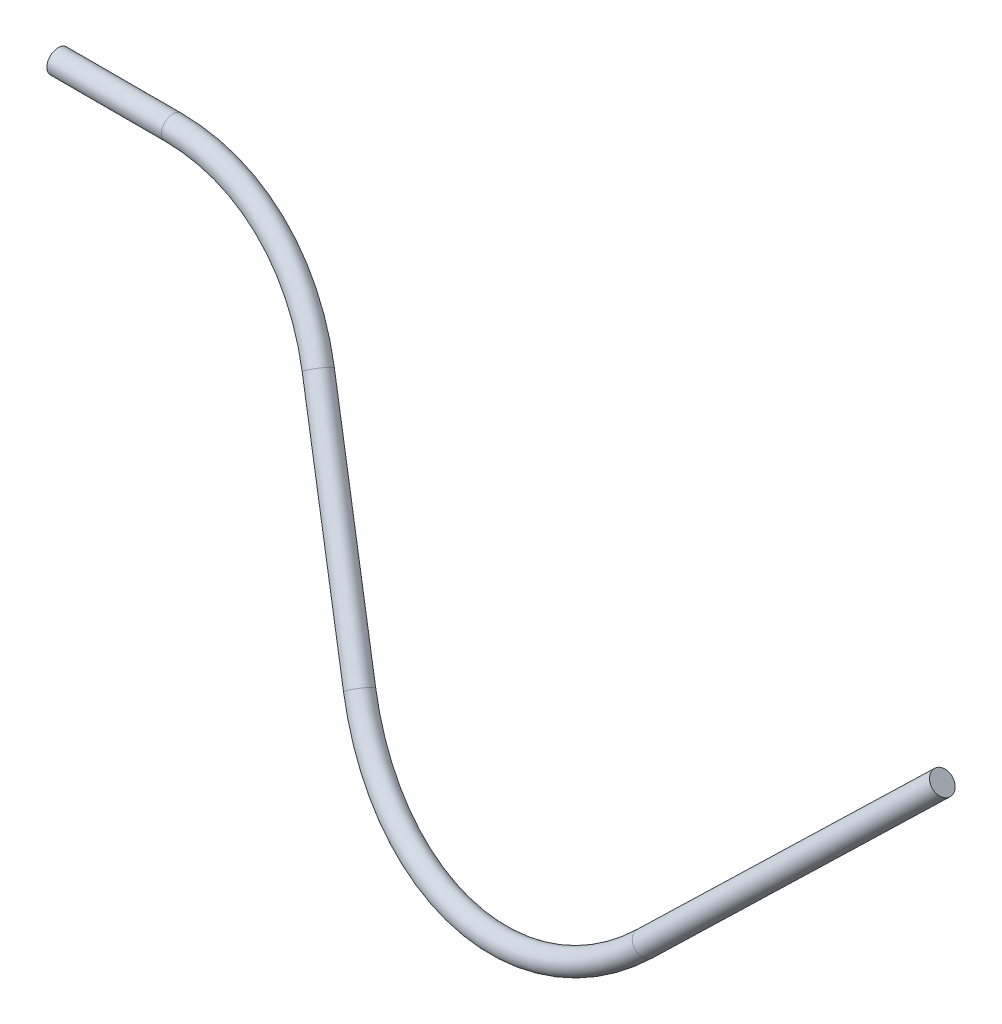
ISO-10303-21;
HEADER;
FILE_DESCRIPTION(('STEP AP214'),'2;1');
FILE_NAME('part.step','',(''),(''),'','','');
FILE_SCHEMA(('AUTOMOTIVE_DESIGN { 1 0 10303 214 1 1 1 1 }'));
ENDSEC;
DATA;
#1=APPLICATION_CONTEXT('core data for automotive mechanical design processes');
#2=APPLICATION_PROTOCOL_DEFINITION('international standard','automotive_design',2000,#1);
#3=PRODUCT_CONTEXT('',#1,'mechanical');
#4=PRODUCT('Part','Part','',(#3));
#5=PRODUCT_RELATED_PRODUCT_CATEGORY('part','',(#4));
#6=PRODUCT_DEFINITION_FORMATION('','',#4);
#7=PRODUCT_DEFINITION_CONTEXT('part definition',#1,'design');
#8=PRODUCT_DEFINITION('design','',#6,#7);
#9=PRODUCT_DEFINITION_SHAPE('','',#8);
#10=(LENGTH_UNIT() NAMED_UNIT(*) SI_UNIT(.MILLI.,.METRE.));
#11=(NAMED_UNIT(*) PLANE_ANGLE_UNIT() SI_UNIT($,.RADIAN.));
#12=(NAMED_UNIT(*) SI_UNIT($,.STERADIAN.) SOLID_ANGLE_UNIT());
#13=UNCERTAINTY_MEASURE_WITH_UNIT(LENGTH_MEASURE(1.E-05),#10,'distance_accuracy_value','');
#14=(GEOMETRIC_REPRESENTATION_CONTEXT(3) GLOBAL_UNCERTAINTY_ASSIGNED_CONTEXT((#13)) GLOBAL_UNIT_ASSIGNED_CONTEXT((#10,
#11,#12)) REPRESENTATION_CONTEXT('',''));
#15=CARTESIAN_POINT('',(0.,0.,0.));
#16=DIRECTION('',(0.,0.,1.));
#17=DIRECTION('',(1.,0.,0.));
#18=AXIS2_PLACEMENT_3D('',#15,#16,#17);
#19=CARTESIAN_POINT('',(339.366727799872,-121.67592486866,83.6237038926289));
#20=DIRECTION('',(0.712204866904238,0.685424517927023,-0.151517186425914));
#21=DIRECTION('',(-0.693430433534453,0.720523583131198,0.));
#22=AXIS2_PLACEMENT_3D('',#19,#20,#21);
#23=CYLINDRICAL_SURFACE('',#22,5.);
#24=CARTESIAN_POINT('',(339.366727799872,-121.67592486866,83.6237038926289));
#25=DIRECTION('',(0.712204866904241,0.68542451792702,-0.151517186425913));
#26=DIRECTION('',(-0.0571370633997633,-0.158525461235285,-0.985700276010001));
#27=AXIS2_PLACEMENT_3D('',#24,#25,#26);
#28=CIRCLE('',#27,5.);
#29=CARTESIAN_POINT('',(342.801202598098,-124.855855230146,85.3822333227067));
#30=VERTEX_POINT('',#29);
#31=EDGE_CURVE('E37',#30,#30,#28,.T.);
#32=ORIENTED_EDGE('',*,*,#31,.T.);
#33=EDGE_LOOP('',(#32));
#34=FACE_BOUND('',#33,.T.);
#35=CARTESIAN_POINT('',(446.197457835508,-18.8622471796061,60.8961259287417));
#36=DIRECTION('',(0.712204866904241,0.68542451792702,-0.151517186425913));
#37=DIRECTION('',(-0.0571370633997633,-0.158525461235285,-0.985700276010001));
#38=AXIS2_PLACEMENT_3D('',#35,#36,#37);
#39=CIRCLE('',#38,5.);
#40=CARTESIAN_POINT('',(445.911772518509,-19.6548744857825,55.9676245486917));
#41=VERTEX_POINT('',#40);
#42=EDGE_CURVE('E10',#41,#41,#39,.T.);
#43=ORIENTED_EDGE('',*,*,#42,.F.);
#44=EDGE_LOOP('',(#43));
#45=FACE_BOUND('',#44,.T.);
#46=ADVANCED_FACE('F31',(#34,#45),#23,.T.);
#47=CARTESIAN_POINT('',(270.677231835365,-58.0773176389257,48.4531152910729));
#48=DIRECTION('',(-0.14470501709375,0.354563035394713,0.923767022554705));
#49=DIRECTION('',(0.,-0.933593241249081,0.358334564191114));
#50=AXIS2_PLACEMENT_3D('',#47,#48,#49);
#51=TOROIDAL_SURFACE('',#50,100.,5.);
#52=CARTESIAN_POINT('',(188.610938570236,-114.534673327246,57.2673366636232));
#53=DIRECTION('',(0.552786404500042,-0.745346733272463,0.372673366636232));
#54=DIRECTION('',(0.372673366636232,-0.178885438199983,-0.910557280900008));
#55=AXIS2_PLACEMENT_3D('',#52,#53,#54);
#56=CIRCLE('',#55,5.);
#57=CARTESIAN_POINT('',(184.507623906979,-117.357541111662,57.7080477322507));
#58=VERTEX_POINT('',#57);
#59=EDGE_CURVE('E41',#58,#58,#56,.T.);
#60=CARTESIAN_POINT('',(270.677231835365,-58.0773176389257,48.4531152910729));
#61=DIRECTION('',(-0.14470501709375,0.354563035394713,0.923767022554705));
#62=DIRECTION('',(0.,-0.933593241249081,0.358334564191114));
#63=AXIS2_PLACEMENT_3D('',#60,#61,#62);
#64=CIRCLE('',#63,105.);
#65=EDGE_CURVE('',#58,#30,#64,.T.);
#66=ORIENTED_EDGE('',*,*,#59,.T.);
#67=ORIENTED_EDGE('',*,*,#31,.F.);
#68=ORIENTED_EDGE('',*,*,#65,.T.);
#69=ORIENTED_EDGE('',*,*,#65,.F.);
#70=EDGE_LOOP('',(#66,#68,#67,#69));
#71=FACE_BOUND('',#70,.T.);
#72=ADVANCED_FACE('F75',(#71),#51,.T.);
#73=CARTESIAN_POINT('',(133.332298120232,-40.,20.));
#74=DIRECTION('',(0.552786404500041,-0.745346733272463,0.372673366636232));
#75=DIRECTION('',(0.803207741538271,0.595699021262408,0.));
#76=AXIS2_PLACEMENT_3D('',#73,#74,#75);
#77=CYLINDRICAL_SURFACE('',#76,5.);
#78=CARTESIAN_POINT('',(133.332298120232,-40.,20.));
#79=DIRECTION('',(0.552786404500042,-0.745346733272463,0.372673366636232));
#80=DIRECTION('',(0.372673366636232,-0.178885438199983,-0.910557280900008));
#81=AXIS2_PLACEMENT_3D('',#78,#79,#80);
#82=CIRCLE('',#81,5.);
#83=CARTESIAN_POINT('',(137.498913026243,-37.5278640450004,18.7639320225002));
#84=VERTEX_POINT('',#83);
#85=EDGE_CURVE('E45',#84,#84,#82,.T.);
#86=ORIENTED_EDGE('',*,*,#85,.T.);
#87=EDGE_LOOP('',(#86));
#88=FACE_BOUND('',#87,.T.);
#89=ORIENTED_EDGE('',*,*,#59,.F.);
#90=EDGE_LOOP('',(#89));
#91=FACE_BOUND('',#90,.T.);
#92=ADVANCED_FACE('F79',(#88,#91),#77,.T.);
#93=CARTESIAN_POINT('',(50.,-89.4427190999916,44.7213595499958));
#94=DIRECTION('',(0.,-0.447213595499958,-0.894427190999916));
#95=DIRECTION('',(0.,0.894427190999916,-0.447213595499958));
#96=AXIS2_PLACEMENT_3D('',#93,#94,#95);
#97=TOROIDAL_SURFACE('',#96,100.,5.);
#98=CARTESIAN_POINT('',(50.,0.,0.));
#99=DIRECTION('',(1.,0.,0.));
#100=DIRECTION('',(0.,0.,-1.));
#101=AXIS2_PLACEMENT_3D('',#98,#99,#100);
#102=CIRCLE('',#101,5.);
#103=CARTESIAN_POINT('',(50.,4.47213595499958,-2.2360679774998));
#104=VERTEX_POINT('',#103);
#105=EDGE_CURVE('E50',#104,#104,#102,.T.);
#106=CARTESIAN_POINT('',(50.,-89.4427190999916,44.7213595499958));
#107=DIRECTION('',(0.,-0.447213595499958,-0.894427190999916));
#108=DIRECTION('',(0.,0.894427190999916,-0.447213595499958));
#109=AXIS2_PLACEMENT_3D('',#106,#107,#108);
#110=CIRCLE('',#109,105.);
#111=EDGE_CURVE('',#104,#84,#110,.T.);
#112=ORIENTED_EDGE('',*,*,#105,.T.);
#113=ORIENTED_EDGE('',*,*,#85,.F.);
#114=ORIENTED_EDGE('',*,*,#111,.T.);
#115=ORIENTED_EDGE('',*,*,#111,.F.);
#116=EDGE_LOOP('',(#112,#114,#113,#115));
#117=FACE_BOUND('',#116,.T.);
#118=ADVANCED_FACE('F57',(#117),#97,.T.);
#119=CARTESIAN_POINT('',(50.,0.,0.));
#120=DIRECTION('',(-1.,0.,0.));
#121=DIRECTION('',(0.,0.,1.));
#122=AXIS2_PLACEMENT_3D('',#119,#120,#121);
#123=CYLINDRICAL_SURFACE('',#122,5.);
#124=ORIENTED_EDGE('',*,*,#105,.F.);
#125=EDGE_LOOP('',(#124));
#126=FACE_BOUND('',#125,.T.);
#127=CARTESIAN_POINT('',(0.,0.,0.));
#128=DIRECTION('',(1.,0.,0.));
#129=DIRECTION('',(0.,0.,-1.));
#130=AXIS2_PLACEMENT_3D('',#127,#128,#129);
#131=CIRCLE('',#130,5.);
#132=CARTESIAN_POINT('',(0.,0.,-5.));
#133=VERTEX_POINT('',#132);
#134=EDGE_CURVE('E51',#133,#133,#131,.T.);
#135=ORIENTED_EDGE('',*,*,#134,.T.);
#136=EDGE_LOOP('',(#135));
#137=FACE_BOUND('',#136,.T.);
#138=ADVANCED_FACE('F60',(#126,#137),#123,.T.);
#139=CARTESIAN_POINT('',(446.197457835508,-18.8622471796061,60.8961259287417));
#140=DIRECTION('',(0.712204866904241,0.68542451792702,-0.151517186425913));
#141=DIRECTION('',(-0.0571370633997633,-0.158525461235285,-0.985700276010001));
#142=AXIS2_PLACEMENT_3D('',#139,#140,#141);
#143=PLANE('',#142);
#144=ORIENTED_EDGE('',*,*,#42,.T.);
#145=EDGE_LOOP('',(#144));
#146=FACE_BOUND('',#145,.T.);
#147=ADVANCED_FACE('F63',(#146),#143,.T.);
#148=CARTESIAN_POINT('',(0.,0.,0.));
#149=DIRECTION('',(1.,0.,0.));
#150=DIRECTION('',(0.,0.,-1.));
#151=AXIS2_PLACEMENT_3D('',#148,#149,#150);
#152=PLANE('',#151);
#153=ORIENTED_EDGE('',*,*,#134,.F.);
#154=EDGE_LOOP('',(#153));
#155=FACE_BOUND('',#154,.T.);
#156=ADVANCED_FACE('F67',(#155),#152,.F.);
#157=CLOSED_SHELL('',(#46,#72,#92,#118,#138,#147,#156));
#158=MANIFOLD_SOLID_BREP('B2',#157);
#159=ADVANCED_BREP_SHAPE_REPRESENTATION('',(#18,#158),#14);
#160=SHAPE_DEFINITION_REPRESENTATION(#9,#159);
ENDSEC;
END-ISO-10303-21;
